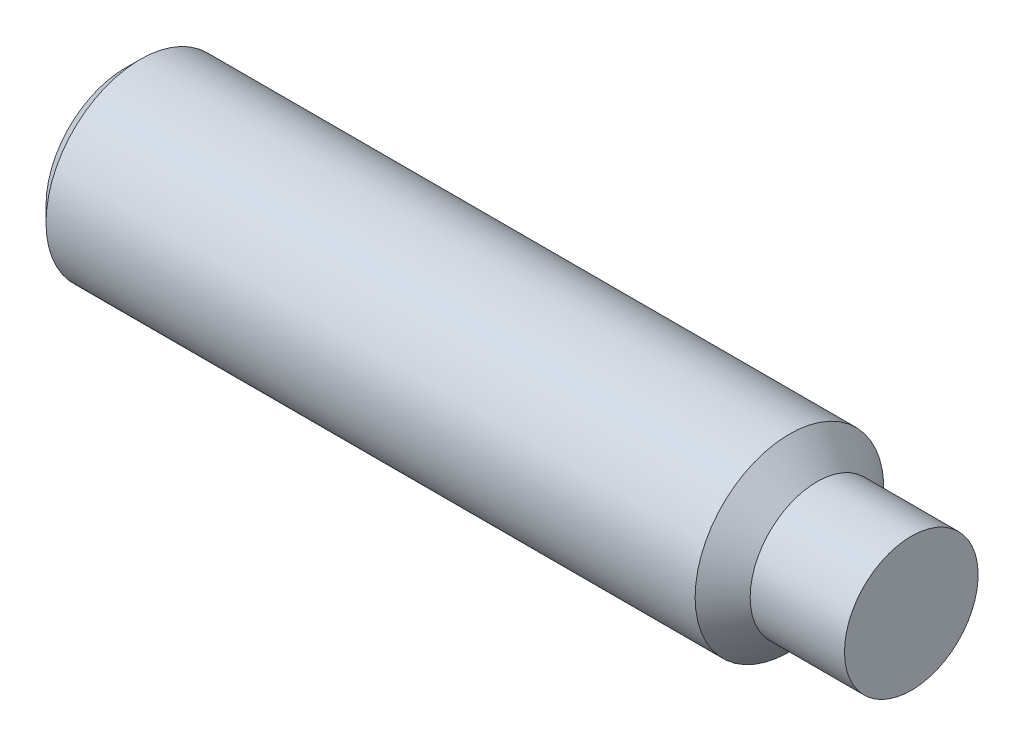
ISO-10303-21;
HEADER;
FILE_DESCRIPTION(('STEP AP214'),'2;1');
FILE_NAME('part.step','',(''),(''),'','','');
FILE_SCHEMA(('AUTOMOTIVE_DESIGN { 1 0 10303 214 1 1 1 1 }'));
ENDSEC;
DATA;
#1=APPLICATION_CONTEXT('core data for automotive mechanical design processes');
#2=APPLICATION_PROTOCOL_DEFINITION('international standard','automotive_design',2000,#1);
#3=PRODUCT_CONTEXT('',#1,'mechanical');
#4=PRODUCT('Part','Part','',(#3));
#5=PRODUCT_RELATED_PRODUCT_CATEGORY('part','',(#4));
#6=PRODUCT_DEFINITION_FORMATION('','',#4);
#7=PRODUCT_DEFINITION_CONTEXT('part definition',#1,'design');
#8=PRODUCT_DEFINITION('design','',#6,#7);
#9=PRODUCT_DEFINITION_SHAPE('','',#8);
#10=(LENGTH_UNIT() NAMED_UNIT(*) SI_UNIT(.MILLI.,.METRE.));
#11=(NAMED_UNIT(*) PLANE_ANGLE_UNIT() SI_UNIT($,.RADIAN.));
#12=(NAMED_UNIT(*) SI_UNIT($,.STERADIAN.) SOLID_ANGLE_UNIT());
#13=UNCERTAINTY_MEASURE_WITH_UNIT(LENGTH_MEASURE(1.E-05),#10,'distance_accuracy_value','');
#14=(GEOMETRIC_REPRESENTATION_CONTEXT(3) GLOBAL_UNCERTAINTY_ASSIGNED_CONTEXT((#13)) GLOBAL_UNIT_ASSIGNED_CONTEXT((#10,
#11,#12)) REPRESENTATION_CONTEXT('',''));
#15=CARTESIAN_POINT('',(0.,0.,0.));
#16=DIRECTION('',(0.,0.,1.));
#17=DIRECTION('',(1.,0.,0.));
#18=AXIS2_PLACEMENT_3D('',#15,#16,#17);
#19=CARTESIAN_POINT('',(0.,0.,0.));
#20=DIRECTION('',(1.,0.,0.));
#21=DIRECTION('',(0.,0.,-1.));
#22=AXIS2_PLACEMENT_3D('',#19,#20,#21);
#23=PLANE('',#22);
#24=CARTESIAN_POINT('',(0.,0.,0.));
#25=DIRECTION('',(-1.,0.,0.));
#26=DIRECTION('',(0.,0.,1.));
#27=AXIS2_PLACEMENT_3D('',#24,#25,#26);
#28=CIRCLE('',#27,5.036);
#29=CARTESIAN_POINT('',(0.,0.,5.036));
#30=VERTEX_POINT('',#29);
#31=EDGE_CURVE('E11',#30,#30,#28,.T.);
#32=ORIENTED_EDGE('',*,*,#31,.T.);
#33=EDGE_LOOP('',(#32));
#34=FACE_BOUND('',#33,.T.);
#35=DIRECTION('',(0.,0.5,0.866025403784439));
#36=VECTOR('',#35,1.);
#37=CARTESIAN_POINT('',(0.,1.73205080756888,-3.));
#38=LINE('',#37,#36);
#39=CARTESIAN_POINT('',(0.,1.73205080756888,-3.));
#40=VERTEX_POINT('',#39);
#41=CARTESIAN_POINT('',(0.,3.46410161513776,0.));
#42=VERTEX_POINT('',#41);
#43=EDGE_CURVE('E47',#40,#42,#38,.T.);
#44=ORIENTED_EDGE('',*,*,#43,.T.);
#45=DIRECTION('',(0.,-0.5,0.866025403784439));
#46=VECTOR('',#45,1.);
#47=CARTESIAN_POINT('',(0.,3.46410161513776,0.));
#48=LINE('',#47,#46);
#49=CARTESIAN_POINT('',(0.,1.73205080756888,3.));
#50=VERTEX_POINT('',#49);
#51=EDGE_CURVE('E118',#42,#50,#48,.T.);
#52=ORIENTED_EDGE('',*,*,#51,.T.);
#53=DIRECTION('',(0.,-1.,0.));
#54=VECTOR('',#53,1.);
#55=CARTESIAN_POINT('',(0.,1.73205080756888,3.));
#56=LINE('',#55,#54);
#57=CARTESIAN_POINT('',(0.,-1.73205080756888,3.));
#58=VERTEX_POINT('',#57);
#59=EDGE_CURVE('E121',#50,#58,#56,.T.);
#60=ORIENTED_EDGE('',*,*,#59,.T.);
#61=DIRECTION('',(0.,-0.5,-0.866025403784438));
#62=VECTOR('',#61,1.);
#63=CARTESIAN_POINT('',(0.,-1.73205080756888,3.));
#64=LINE('',#63,#62);
#65=CARTESIAN_POINT('',(0.,-3.46410161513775,0.));
#66=VERTEX_POINT('',#65);
#67=EDGE_CURVE('E124',#58,#66,#64,.T.);
#68=ORIENTED_EDGE('',*,*,#67,.T.);
#69=DIRECTION('',(0.,0.5,-0.866025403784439));
#70=VECTOR('',#69,1.);
#71=CARTESIAN_POINT('',(0.,-3.46410161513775,0.));
#72=LINE('',#71,#70);
#73=CARTESIAN_POINT('',(0.,-1.73205080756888,-3.));
#74=VERTEX_POINT('',#73);
#75=EDGE_CURVE('E108',#66,#74,#72,.T.);
#76=ORIENTED_EDGE('',*,*,#75,.T.);
#77=DIRECTION('',(0.,1.,0.));
#78=VECTOR('',#77,1.);
#79=CARTESIAN_POINT('',(0.,-1.73205080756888,-3.));
#80=LINE('',#79,#78);
#81=EDGE_CURVE('E127',#74,#40,#80,.T.);
#82=ORIENTED_EDGE('',*,*,#81,.T.);
#83=EDGE_LOOP('',(#44,#52,#60,#68,#76,#82));
#84=FACE_BOUND('',#83,.T.);
#85=ADVANCED_FACE('F33',(#34,#84),#23,.F.);
#86=CARTESIAN_POINT('',(0.964,0.,0.));
#87=DIRECTION('',(1.,0.,0.));
#88=DIRECTION('',(0.,0.,-1.));
#89=AXIS2_PLACEMENT_3D('',#86,#87,#88);
#90=CONICAL_SURFACE('',#89,6.,0.785398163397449);
#91=ORIENTED_EDGE('',*,*,#31,.F.);
#92=EDGE_LOOP('',(#91));
#93=FACE_BOUND('',#92,.T.);
#94=CARTESIAN_POINT('',(0.964,0.,0.));
#95=DIRECTION('',(-1.,0.,0.));
#96=DIRECTION('',(0.,0.,1.));
#97=AXIS2_PLACEMENT_3D('',#94,#95,#96);
#98=CIRCLE('',#97,6.);
#99=CARTESIAN_POINT('',(0.964,0.,6.));
#100=VERTEX_POINT('',#99);
#101=EDGE_CURVE('E40',#100,#100,#98,.T.);
#102=ORIENTED_EDGE('',*,*,#101,.T.);
#103=EDGE_LOOP('',(#102));
#104=FACE_BOUND('',#103,.T.);
#105=ADVANCED_FACE('F149',(#93,#104),#90,.T.);
#106=CARTESIAN_POINT('',(0.,0.,0.));
#107=DIRECTION('',(-1.,0.,0.));
#108=DIRECTION('',(0.,0.,1.));
#109=AXIS2_PLACEMENT_3D('',#106,#107,#108);
#110=CYLINDRICAL_SURFACE('',#109,6.);
#111=ORIENTED_EDGE('',*,*,#101,.F.);
#112=EDGE_LOOP('',(#111));
#113=FACE_BOUND('',#112,.T.);
#114=CARTESIAN_POINT('',(42.25,0.,0.));
#115=DIRECTION('',(-1.,0.,0.));
#116=DIRECTION('',(0.,0.,1.));
#117=AXIS2_PLACEMENT_3D('',#114,#115,#116);
#118=CIRCLE('',#117,6.);
#119=CARTESIAN_POINT('',(42.25,0.,6.));
#120=VERTEX_POINT('',#119);
#121=EDGE_CURVE('E144',#120,#120,#118,.T.);
#122=ORIENTED_EDGE('',*,*,#121,.T.);
#123=EDGE_LOOP('',(#122));
#124=FACE_BOUND('',#123,.T.);
#125=ADVANCED_FACE('F151',(#113,#124),#110,.T.);
#126=CARTESIAN_POINT('',(44.,0.,0.));
#127=DIRECTION('',(-1.,0.,0.));
#128=DIRECTION('',(0.,0.,1.));
#129=AXIS2_PLACEMENT_3D('',#126,#127,#128);
#130=CONICAL_SURFACE('',#129,4.25,0.785398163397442);
#131=ORIENTED_EDGE('',*,*,#121,.F.);
#132=EDGE_LOOP('',(#131));
#133=FACE_BOUND('',#132,.T.);
#134=CARTESIAN_POINT('',(44.,0.,0.));
#135=DIRECTION('',(-1.,0.,0.));
#136=DIRECTION('',(0.,0.,1.));
#137=AXIS2_PLACEMENT_3D('',#134,#135,#136);
#138=CIRCLE('',#137,4.25);
#139=CARTESIAN_POINT('',(44.,0.,4.25));
#140=VERTEX_POINT('',#139);
#141=EDGE_CURVE('E141',#140,#140,#138,.T.);
#142=ORIENTED_EDGE('',*,*,#141,.T.);
#143=EDGE_LOOP('',(#142));
#144=FACE_BOUND('',#143,.T.);
#145=ADVANCED_FACE('F154',(#133,#144),#130,.T.);
#146=CARTESIAN_POINT('',(0.,0.,0.));
#147=DIRECTION('',(-1.,0.,0.));
#148=DIRECTION('',(0.,0.,1.));
#149=AXIS2_PLACEMENT_3D('',#146,#147,#148);
#150=CYLINDRICAL_SURFACE('',#149,4.25);
#151=ORIENTED_EDGE('',*,*,#141,.F.);
#152=EDGE_LOOP('',(#151));
#153=FACE_BOUND('',#152,.T.);
#154=CARTESIAN_POINT('',(50.,0.,0.));
#155=DIRECTION('',(-1.,0.,0.));
#156=DIRECTION('',(0.,0.,1.));
#157=AXIS2_PLACEMENT_3D('',#154,#155,#156);
#158=CIRCLE('',#157,4.25);
#159=CARTESIAN_POINT('',(50.,0.,4.25));
#160=VERTEX_POINT('',#159);
#161=EDGE_CURVE('E138',#160,#160,#158,.T.);
#162=ORIENTED_EDGE('',*,*,#161,.T.);
#163=EDGE_LOOP('',(#162));
#164=FACE_BOUND('',#163,.T.);
#165=ADVANCED_FACE('F160',(#153,#164),#150,.T.);
#166=CARTESIAN_POINT('',(50.,4.25,0.));
#167=DIRECTION('',(-1.,0.,0.));
#168=DIRECTION('',(0.,0.,1.));
#169=AXIS2_PLACEMENT_3D('',#166,#167,#168);
#170=PLANE('',#169);
#171=ORIENTED_EDGE('',*,*,#161,.F.);
#172=EDGE_LOOP('',(#171));
#173=FACE_BOUND('',#172,.T.);
#174=ADVANCED_FACE('F166',(#173),#170,.F.);
#175=CARTESIAN_POINT('',(8.,1.73205080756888,-3.));
#176=DIRECTION('',(0.,-0.866025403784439,0.5));
#177=DIRECTION('',(0.,-0.5,-0.866025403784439));
#178=AXIS2_PLACEMENT_3D('',#175,#176,#177);
#179=PLANE('',#178);
#180=ORIENTED_EDGE('',*,*,#43,.F.);
#181=DIRECTION('',(-1.,0.,0.));
#182=VECTOR('',#181,1.);
#183=CARTESIAN_POINT('',(8.,1.73205080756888,-3.));
#184=LINE('',#183,#182);
#185=CARTESIAN_POINT('',(8.,1.73205080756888,-3.));
#186=VERTEX_POINT('',#185);
#187=EDGE_CURVE('E113',#186,#40,#184,.T.);
#188=ORIENTED_EDGE('',*,*,#187,.F.);
#189=DIRECTION('',(0.,0.5,0.866025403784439));
#190=VECTOR('',#189,1.);
#191=CARTESIAN_POINT('',(8.,1.73205080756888,-3.));
#192=LINE('',#191,#190);
#193=CARTESIAN_POINT('',(8.,3.46410161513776,0.));
#194=VERTEX_POINT('',#193);
#195=EDGE_CURVE('E130',#186,#194,#192,.T.);
#196=ORIENTED_EDGE('',*,*,#195,.T.);
#197=DIRECTION('',(-1.,0.,0.));
#198=VECTOR('',#197,1.);
#199=CARTESIAN_POINT('',(8.,3.46410161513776,0.));
#200=LINE('',#199,#198);
#201=EDGE_CURVE('E136',#194,#42,#200,.T.);
#202=ORIENTED_EDGE('',*,*,#201,.T.);
#203=EDGE_LOOP('',(#180,#188,#196,#202));
#204=FACE_BOUND('',#203,.T.);
#205=ADVANCED_FACE('F171',(#204),#179,.T.);
#206=CARTESIAN_POINT('',(8.,3.46410161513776,0.));
#207=DIRECTION('',(0.,-0.866025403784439,-0.5));
#208=DIRECTION('',(0.,0.5,-0.866025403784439));
#209=AXIS2_PLACEMENT_3D('',#206,#207,#208);
#210=PLANE('',#209);
#211=ORIENTED_EDGE('',*,*,#51,.F.);
#212=ORIENTED_EDGE('',*,*,#201,.F.);
#213=DIRECTION('',(0.,-0.5,0.866025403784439));
#214=VECTOR('',#213,1.);
#215=CARTESIAN_POINT('',(8.,3.46410161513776,0.));
#216=LINE('',#215,#214);
#217=CARTESIAN_POINT('',(8.,1.73205080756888,3.));
#218=VERTEX_POINT('',#217);
#219=EDGE_CURVE('E86',#194,#218,#216,.T.);
#220=ORIENTED_EDGE('',*,*,#219,.T.);
#221=DIRECTION('',(-1.,0.,0.));
#222=VECTOR('',#221,1.);
#223=CARTESIAN_POINT('',(8.,1.73205080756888,3.));
#224=LINE('',#223,#222);
#225=EDGE_CURVE('E134',#218,#50,#224,.T.);
#226=ORIENTED_EDGE('',*,*,#225,.T.);
#227=EDGE_LOOP('',(#211,#212,#220,#226));
#228=FACE_BOUND('',#227,.T.);
#229=ADVANCED_FACE('F176',(#228),#210,.T.);
#230=CARTESIAN_POINT('',(8.,1.73205080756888,3.));
#231=DIRECTION('',(0.,0.,-1.));
#232=DIRECTION('',(-1.,0.,0.));
#233=AXIS2_PLACEMENT_3D('',#230,#231,#232);
#234=PLANE('',#233);
#235=ORIENTED_EDGE('',*,*,#59,.F.);
#236=ORIENTED_EDGE('',*,*,#225,.F.);
#237=DIRECTION('',(0.,-1.,0.));
#238=VECTOR('',#237,1.);
#239=CARTESIAN_POINT('',(8.,1.73205080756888,3.));
#240=LINE('',#239,#238);
#241=CARTESIAN_POINT('',(8.,-1.73205080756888,3.));
#242=VERTEX_POINT('',#241);
#243=EDGE_CURVE('E104',#218,#242,#240,.T.);
#244=ORIENTED_EDGE('',*,*,#243,.T.);
#245=DIRECTION('',(-1.,0.,0.));
#246=VECTOR('',#245,1.);
#247=CARTESIAN_POINT('',(8.,-1.73205080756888,3.));
#248=LINE('',#247,#246);
#249=EDGE_CURVE('E101',#242,#58,#248,.T.);
#250=ORIENTED_EDGE('',*,*,#249,.T.);
#251=EDGE_LOOP('',(#235,#236,#244,#250));
#252=FACE_BOUND('',#251,.T.);
#253=ADVANCED_FACE('F193',(#252),#234,.T.);
#254=CARTESIAN_POINT('',(8.,-1.73205080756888,3.));
#255=DIRECTION('',(0.,0.866025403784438,-0.5));
#256=DIRECTION('',(0.,0.5,0.866025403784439));
#257=AXIS2_PLACEMENT_3D('',#254,#255,#256);
#258=PLANE('',#257);
#259=ORIENTED_EDGE('',*,*,#67,.F.);
#260=ORIENTED_EDGE('',*,*,#249,.F.);
#261=DIRECTION('',(0.,-0.5,-0.866025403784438));
#262=VECTOR('',#261,1.);
#263=CARTESIAN_POINT('',(8.,-1.73205080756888,3.));
#264=LINE('',#263,#262);
#265=CARTESIAN_POINT('',(8.,-3.46410161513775,0.));
#266=VERTEX_POINT('',#265);
#267=EDGE_CURVE('E96',#242,#266,#264,.T.);
#268=ORIENTED_EDGE('',*,*,#267,.T.);
#269=DIRECTION('',(-1.,0.,0.));
#270=VECTOR('',#269,1.);
#271=CARTESIAN_POINT('',(8.,-3.46410161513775,0.));
#272=LINE('',#271,#270);
#273=EDGE_CURVE('E100',#266,#66,#272,.T.);
#274=ORIENTED_EDGE('',*,*,#273,.T.);
#275=EDGE_LOOP('',(#259,#260,#268,#274));
#276=FACE_BOUND('',#275,.T.);
#277=ADVANCED_FACE('F99',(#276),#258,.T.);
#278=CARTESIAN_POINT('',(8.,-3.46410161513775,0.));
#279=DIRECTION('',(0.,0.866025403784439,0.5));
#280=DIRECTION('',(0.,-0.5,0.866025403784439));
#281=AXIS2_PLACEMENT_3D('',#278,#279,#280);
#282=PLANE('',#281);
#283=ORIENTED_EDGE('',*,*,#75,.F.);
#284=ORIENTED_EDGE('',*,*,#273,.F.);
#285=DIRECTION('',(0.,0.5,-0.866025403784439));
#286=VECTOR('',#285,1.);
#287=CARTESIAN_POINT('',(8.,-3.46410161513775,0.));
#288=LINE('',#287,#286);
#289=CARTESIAN_POINT('',(8.,-1.73205080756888,-3.));
#290=VERTEX_POINT('',#289);
#291=EDGE_CURVE('E103',#266,#290,#288,.T.);
#292=ORIENTED_EDGE('',*,*,#291,.T.);
#293=DIRECTION('',(-1.,0.,0.));
#294=VECTOR('',#293,1.);
#295=CARTESIAN_POINT('',(8.,-1.73205080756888,-3.));
#296=LINE('',#295,#294);
#297=EDGE_CURVE('E77',#290,#74,#296,.T.);
#298=ORIENTED_EDGE('',*,*,#297,.T.);
#299=EDGE_LOOP('',(#283,#284,#292,#298));
#300=FACE_BOUND('',#299,.T.);
#301=ADVANCED_FACE('F106',(#300),#282,.T.);
#302=CARTESIAN_POINT('',(8.,-1.73205080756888,-3.));
#303=DIRECTION('',(0.,0.,1.));
#304=DIRECTION('',(1.,0.,0.));
#305=AXIS2_PLACEMENT_3D('',#302,#303,#304);
#306=PLANE('',#305);
#307=ORIENTED_EDGE('',*,*,#81,.F.);
#308=ORIENTED_EDGE('',*,*,#297,.F.);
#309=DIRECTION('',(0.,1.,0.));
#310=VECTOR('',#309,1.);
#311=CARTESIAN_POINT('',(8.,-1.73205080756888,-3.));
#312=LINE('',#311,#310);
#313=EDGE_CURVE('E55',#290,#186,#312,.T.);
#314=ORIENTED_EDGE('',*,*,#313,.T.);
#315=ORIENTED_EDGE('',*,*,#187,.T.);
#316=EDGE_LOOP('',(#307,#308,#314,#315));
#317=FACE_BOUND('',#316,.T.);
#318=ADVANCED_FACE('F186',(#317),#306,.T.);
#319=CARTESIAN_POINT('',(8.,5.19615242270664,3.));
#320=DIRECTION('',(1.,0.,0.));
#321=DIRECTION('',(0.,0.,-1.));
#322=AXIS2_PLACEMENT_3D('',#319,#320,#321);
#323=PLANE('',#322);
#324=ORIENTED_EDGE('',*,*,#195,.F.);
#325=ORIENTED_EDGE('',*,*,#313,.F.);
#326=ORIENTED_EDGE('',*,*,#291,.F.);
#327=ORIENTED_EDGE('',*,*,#267,.F.);
#328=ORIENTED_EDGE('',*,*,#243,.F.);
#329=ORIENTED_EDGE('',*,*,#219,.F.);
#330=EDGE_LOOP('',(#324,#325,#326,#327,#328,#329));
#331=FACE_BOUND('',#330,.T.);
#332=ADVANCED_FACE('F111',(#331),#323,.F.);
#333=CLOSED_SHELL('',(#85,#105,#125,#145,#165,#174,#205,#229,#253,#277,#301,#318,#332));
#334=MANIFOLD_SOLID_BREP('B2',#333);
#335=ADVANCED_BREP_SHAPE_REPRESENTATION('',(#18,#334),#14);
#336=SHAPE_DEFINITION_REPRESENTATION(#9,#335);
ENDSEC;
END-ISO-10303-21;
